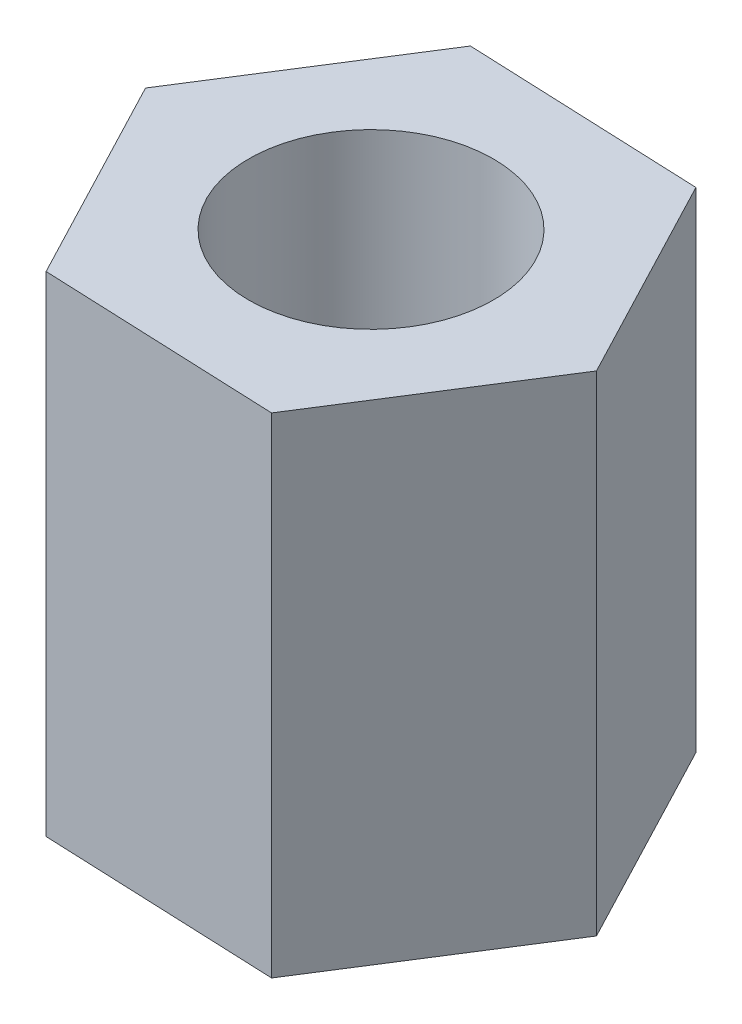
from build123d import *

# Parameters (mm, degrees)
SKIZZE1_R                       = 1.5
AUFSATZ_LINEAR_AUSTRAGEN1_DEPTH = 6


with BuildPart() as part:
    # Skizze1 → Aufsatz-Linear austragen1 (new body)
    with BuildSketch(Plane(origin=(0, 0, 0), x_dir=(1, 0, 0), z_dir=(0, 1, 0))):
        Polygon((1.338535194, -2.557666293), (2.884271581, -0.119627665), (1.545736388, 2.438038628), (-1.338535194, 2.557666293), (-2.884271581, 0.119627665), (-1.545736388, -2.438038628), align=None)
        with Locations(Location((0, 0, 0), (0, 0, 270))):
            Circle(SKIZZE1_R, mode=Mode.SUBTRACT)
    extrude(amount=AUFSATZ_LINEAR_AUSTRAGEN1_DEPTH)


solid = part.part
